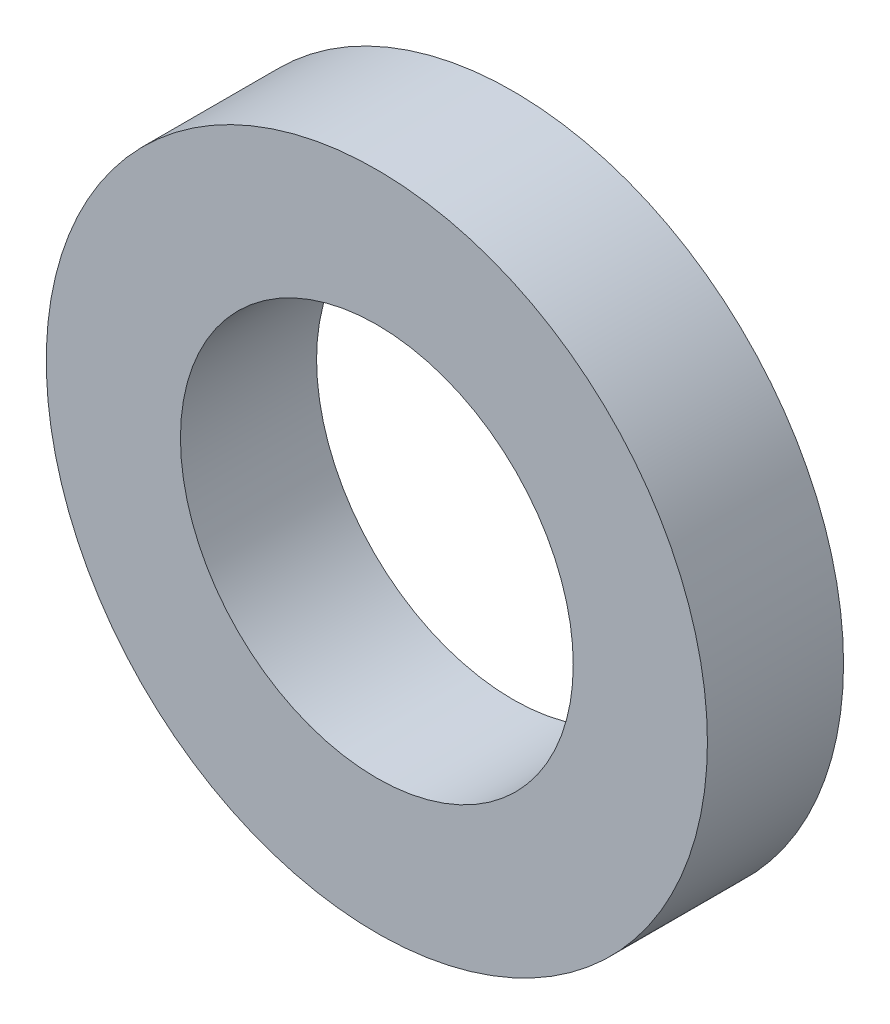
from build123d import *

# Parameters (mm, degrees)
SKETCH_1_R                           = 17
SKETCH_1_R_2                         = 10.1
WRIST_BEARING_20X34X7_ENVELOPE_DEPTH = 3.5


with BuildPart() as part:
    # Sketch 1 → Wrist_Bearing_20x34x7_Envelope (new, symmetric)
    with BuildSketch(Plane.XY):
        Circle(SKETCH_1_R)
        Circle(SKETCH_1_R_2, mode=Mode.SUBTRACT)
    extrude(amount=WRIST_BEARING_20X34X7_ENVELOPE_DEPTH, both=True)


solid = part.part
